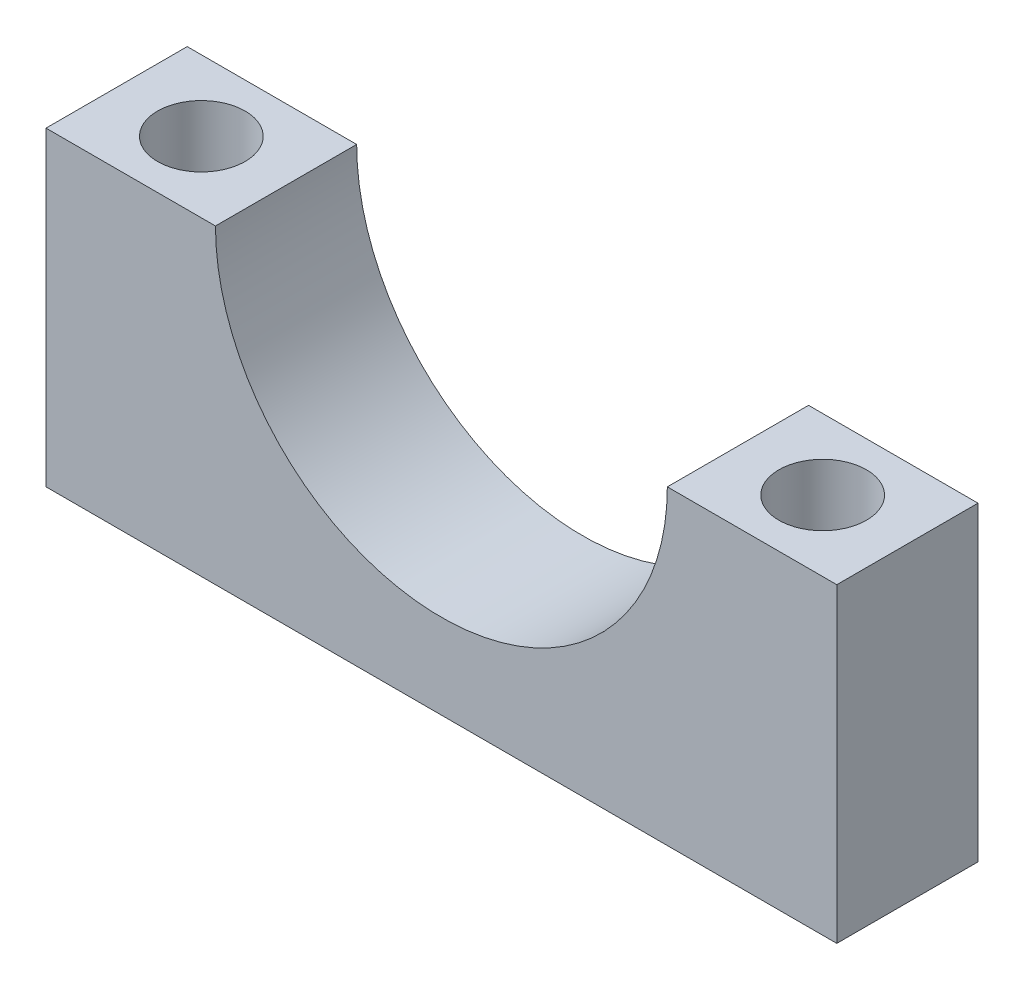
from build123d import *

# Parameters (mm, degrees)
EXTRUDE_1_DEPTH     = 5
SKETCH_2_R          = 1.55
CUT_EXTRUDE_1_DEPTH = 19.493242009


with BuildPart() as part:
    # Sketch 1 → Extrude 1 (new body)
    with BuildSketch(Plane.XY):
        with BuildLine():
            Line((-8, 5.5), (-14, 5.5))
            Line((-14, 5.5), (-14, -5.5))
            Line((-14, -5.5), (14, -5.5))
            Line((14, -5.5), (14, 5.5))
            Line((14, 5.5), (8, 5.5))
            ThreePointArc((8, 5.5), (0, -2.5), (-8, 5.5))
        make_face()
    extrude(amount=EXTRUDE_1_DEPTH)

    # Sketch 2 → Cut-Extrude 1 (cut, through all)
    with BuildSketch(Plane.XZ.offset(5.5)):
        with Locations(Location((-11, 2.5, 0), (0, 0, 270))):
            Circle(SKETCH_2_R)
        with Locations(Location((11, 2.5, 0), (0, 0, 270))):
            Circle(SKETCH_2_R)
    extrude(amount=-CUT_EXTRUDE_1_DEPTH, mode=Mode.SUBTRACT)


solid = part.part
